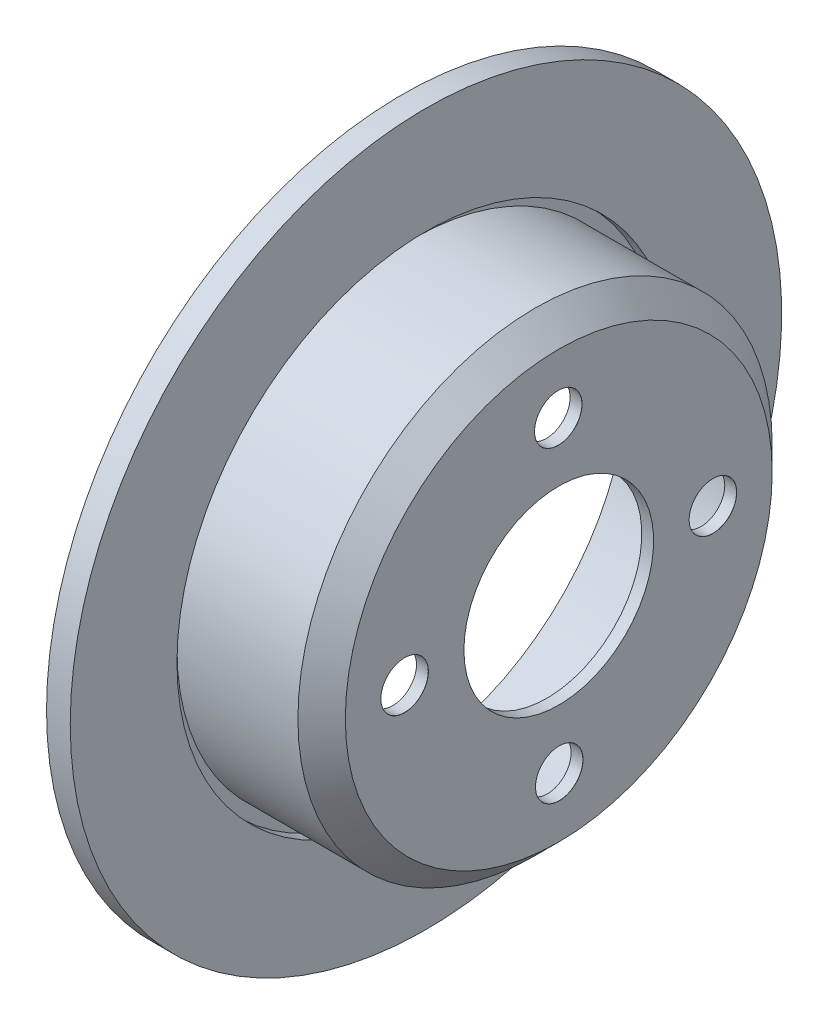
ISO-10303-21;
HEADER;
FILE_DESCRIPTION(('STEP AP214'),'2;1');
FILE_NAME('part.step','',(''),(''),'','','');
FILE_SCHEMA(('AUTOMOTIVE_DESIGN { 1 0 10303 214 1 1 1 1 }'));
ENDSEC;
DATA;
#1=APPLICATION_CONTEXT('core data for automotive mechanical design processes');
#2=APPLICATION_PROTOCOL_DEFINITION('international standard','automotive_design',2000,#1);
#3=PRODUCT_CONTEXT('',#1,'mechanical');
#4=PRODUCT('Part','Part','',(#3));
#5=PRODUCT_RELATED_PRODUCT_CATEGORY('part','',(#4));
#6=PRODUCT_DEFINITION_FORMATION('','',#4);
#7=PRODUCT_DEFINITION_CONTEXT('part definition',#1,'design');
#8=PRODUCT_DEFINITION('design','',#6,#7);
#9=PRODUCT_DEFINITION_SHAPE('','',#8);
#10=(LENGTH_UNIT() NAMED_UNIT(*) SI_UNIT(.MILLI.,.METRE.));
#11=(NAMED_UNIT(*) PLANE_ANGLE_UNIT() SI_UNIT($,.RADIAN.));
#12=(NAMED_UNIT(*) SI_UNIT($,.STERADIAN.) SOLID_ANGLE_UNIT());
#13=UNCERTAINTY_MEASURE_WITH_UNIT(LENGTH_MEASURE(1.E-05),#10,'distance_accuracy_value','');
#14=(GEOMETRIC_REPRESENTATION_CONTEXT(3) GLOBAL_UNCERTAINTY_ASSIGNED_CONTEXT((#13)) GLOBAL_UNIT_ASSIGNED_CONTEXT((#10,
#11,#12)) REPRESENTATION_CONTEXT('',''));
#15=CARTESIAN_POINT('',(0.,0.,0.));
#16=DIRECTION('',(0.,0.,1.));
#17=DIRECTION('',(1.,0.,0.));
#18=AXIS2_PLACEMENT_3D('',#15,#16,#17);
#19=CARTESIAN_POINT('',(0.,0.,0.));
#20=DIRECTION('',(-1.,0.,0.));
#21=DIRECTION('',(0.,0.,1.));
#22=AXIS2_PLACEMENT_3D('',#19,#20,#21);
#23=CYLINDRICAL_SURFACE('',#22,40.);
#24=CARTESIAN_POINT('',(0.,0.,0.));
#25=DIRECTION('',(-1.,0.,0.));
#26=DIRECTION('',(0.,0.,1.));
#27=AXIS2_PLACEMENT_3D('',#24,#25,#26);
#28=CIRCLE('',#27,40.);
#29=CARTESIAN_POINT('',(0.,0.,40.));
#30=VERTEX_POINT('',#29);
#31=EDGE_CURVE('E10',#30,#30,#28,.T.);
#32=ORIENTED_EDGE('',*,*,#31,.F.);
#33=EDGE_LOOP('',(#32));
#34=FACE_BOUND('',#33,.T.);
#35=CARTESIAN_POINT('',(-5.,0.,0.));
#36=DIRECTION('',(-1.,0.,0.));
#37=DIRECTION('',(0.,0.,1.));
#38=AXIS2_PLACEMENT_3D('',#35,#36,#37);
#39=CIRCLE('',#38,40.);
#40=CARTESIAN_POINT('',(-5.,0.,40.));
#41=VERTEX_POINT('',#40);
#42=EDGE_CURVE('E58',#41,#41,#39,.T.);
#43=ORIENTED_EDGE('',*,*,#42,.T.);
#44=EDGE_LOOP('',(#43));
#45=FACE_BOUND('',#44,.T.);
#46=ADVANCED_FACE('F39',(#34,#45),#23,.F.);
#47=CARTESIAN_POINT('',(0.,40.,0.));
#48=DIRECTION('',(-1.,0.,0.));
#49=DIRECTION('',(0.,0.,1.));
#50=AXIS2_PLACEMENT_3D('',#47,#48,#49);
#51=PLANE('',#50);
#52=CARTESIAN_POINT('',(0.,64.9996786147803,0.204401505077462));
#53=DIRECTION('',(1.,0.,0.));
#54=DIRECTION('',(0.,0.,-1.));
#55=AXIS2_PLACEMENT_3D('',#52,#53,#54);
#56=CIRCLE('',#55,10.025);
#57=CARTESIAN_POINT('',(0.,64.9996786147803,-9.82059849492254));
#58=VERTEX_POINT('',#57);
#59=EDGE_CURVE('E205',#58,#58,#56,.T.);
#60=ORIENTED_EDGE('',*,*,#59,.F.);
#61=EDGE_LOOP('',(#60));
#62=FACE_BOUND('',#61,.T.);
#63=CARTESIAN_POINT('',(0.,-0.204401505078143,64.9996786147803));
#64=DIRECTION('',(1.,0.,0.));
#65=DIRECTION('',(0.,0.,-1.));
#66=AXIS2_PLACEMENT_3D('',#63,#64,#65);
#67=CIRCLE('',#66,10.025);
#68=CARTESIAN_POINT('',(0.,-0.204401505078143,54.9746786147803));
#69=VERTEX_POINT('',#68);
#70=EDGE_CURVE('E73',#69,#69,#67,.T.);
#71=ORIENTED_EDGE('',*,*,#70,.F.);
#72=EDGE_LOOP('',(#71));
#73=FACE_BOUND('',#72,.T.);
#74=CARTESIAN_POINT('',(0.,-64.9996786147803,-0.204401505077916));
#75=DIRECTION('',(1.,0.,0.));
#76=DIRECTION('',(0.,0.,-1.));
#77=AXIS2_PLACEMENT_3D('',#74,#75,#76);
#78=CIRCLE('',#77,10.025);
#79=CARTESIAN_POINT('',(0.,-64.9996786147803,-10.2294015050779));
#80=VERTEX_POINT('',#79);
#81=EDGE_CURVE('E66',#80,#80,#78,.T.);
#82=ORIENTED_EDGE('',*,*,#81,.F.);
#83=EDGE_LOOP('',(#82));
#84=FACE_BOUND('',#83,.T.);
#85=CARTESIAN_POINT('',(0.,0.204401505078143,-64.9996786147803));
#86=DIRECTION('',(1.,0.,0.));
#87=DIRECTION('',(0.,0.,-1.));
#88=AXIS2_PLACEMENT_3D('',#85,#86,#87);
#89=CIRCLE('',#88,10.025);
#90=CARTESIAN_POINT('',(0.,0.204401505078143,-75.0246786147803));
#91=VERTEX_POINT('',#90);
#92=EDGE_CURVE('E62',#91,#91,#89,.T.);
#93=ORIENTED_EDGE('',*,*,#92,.F.);
#94=EDGE_LOOP('',(#93));
#95=FACE_BOUND('',#94,.T.);
#96=CARTESIAN_POINT('',(0.,0.,0.));
#97=DIRECTION('',(-1.,0.,0.));
#98=DIRECTION('',(0.,0.,1.));
#99=AXIS2_PLACEMENT_3D('',#96,#97,#98);
#100=CIRCLE('',#99,90.);
#101=CARTESIAN_POINT('',(0.,0.,90.));
#102=VERTEX_POINT('',#101);
#103=EDGE_CURVE('E46',#102,#102,#100,.T.);
#104=ORIENTED_EDGE('',*,*,#103,.F.);
#105=EDGE_LOOP('',(#104));
#106=FACE_BOUND('',#105,.T.);
#107=ORIENTED_EDGE('',*,*,#31,.T.);
#108=EDGE_LOOP('',(#107));
#109=FACE_BOUND('',#108,.T.);
#110=ADVANCED_FACE('F120',(#62,#73,#84,#95,#106,#109),#51,.F.);
#111=CARTESIAN_POINT('',(0.,0.,0.));
#112=DIRECTION('',(-1.,0.,0.));
#113=DIRECTION('',(0.,0.,1.));
#114=AXIS2_PLACEMENT_3D('',#111,#112,#113);
#115=CONICAL_SURFACE('',#114,90.,0.78539816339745);
#116=CARTESIAN_POINT('',(-9.99999999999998,0.,0.));
#117=DIRECTION('',(-1.,0.,0.));
#118=DIRECTION('',(0.,0.,1.));
#119=AXIS2_PLACEMENT_3D('',#116,#117,#118);
#120=CIRCLE('',#119,100.);
#121=CARTESIAN_POINT('',(-9.99999999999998,0.,100.));
#122=VERTEX_POINT('',#121);
#123=EDGE_CURVE('E51',#122,#122,#120,.T.);
#124=ORIENTED_EDGE('',*,*,#123,.F.);
#125=EDGE_LOOP('',(#124));
#126=FACE_BOUND('',#125,.T.);
#127=ORIENTED_EDGE('',*,*,#103,.T.);
#128=EDGE_LOOP('',(#127));
#129=FACE_BOUND('',#128,.T.);
#130=ADVANCED_FACE('F117',(#126,#129),#115,.T.);
#131=CARTESIAN_POINT('',(0.,0.,0.));
#132=DIRECTION('',(-1.,0.,0.));
#133=DIRECTION('',(0.,0.,1.));
#134=AXIS2_PLACEMENT_3D('',#131,#132,#133);
#135=CYLINDRICAL_SURFACE('',#134,100.);
#136=CARTESIAN_POINT('',(-61.,0.,0.));
#137=DIRECTION('',(-1.,0.,0.));
#138=DIRECTION('',(0.,0.,1.));
#139=AXIS2_PLACEMENT_3D('',#136,#137,#138);
#140=CIRCLE('',#139,100.);
#141=CARTESIAN_POINT('',(-61.,0.,100.));
#142=VERTEX_POINT('',#141);
#143=EDGE_CURVE('E110',#142,#142,#140,.T.);
#144=ORIENTED_EDGE('',*,*,#143,.F.);
#145=EDGE_LOOP('',(#144));
#146=FACE_BOUND('',#145,.T.);
#147=ORIENTED_EDGE('',*,*,#123,.T.);
#148=EDGE_LOOP('',(#147));
#149=FACE_BOUND('',#148,.T.);
#150=ADVANCED_FACE('F115',(#146,#149),#135,.T.);
#151=CARTESIAN_POINT('',(-61.,105.,0.));
#152=DIRECTION('',(-1.,0.,0.));
#153=DIRECTION('',(0.,0.,1.));
#154=AXIS2_PLACEMENT_3D('',#151,#152,#153);
#155=PLANE('',#154);
#156=CARTESIAN_POINT('',(-61.,0.,0.));
#157=DIRECTION('',(-1.,0.,0.));
#158=DIRECTION('',(0.,0.,1.));
#159=AXIS2_PLACEMENT_3D('',#156,#157,#158);
#160=CIRCLE('',#159,105.);
#161=CARTESIAN_POINT('',(-61.,0.,105.));
#162=VERTEX_POINT('',#161);
#163=EDGE_CURVE('E107',#162,#162,#160,.T.);
#164=ORIENTED_EDGE('',*,*,#163,.F.);
#165=EDGE_LOOP('',(#164));
#166=FACE_BOUND('',#165,.T.);
#167=ORIENTED_EDGE('',*,*,#143,.T.);
#168=EDGE_LOOP('',(#167));
#169=FACE_BOUND('',#168,.T.);
#170=ADVANCED_FACE('F135',(#166,#169),#155,.F.);
#171=CARTESIAN_POINT('',(0.,0.,0.));
#172=DIRECTION('',(-1.,0.,0.));
#173=DIRECTION('',(0.,0.,1.));
#174=AXIS2_PLACEMENT_3D('',#171,#172,#173);
#175=CYLINDRICAL_SURFACE('',#174,105.);
#176=CARTESIAN_POINT('',(-56.,0.,0.));
#177=DIRECTION('',(-1.,0.,0.));
#178=DIRECTION('',(0.,0.,1.));
#179=AXIS2_PLACEMENT_3D('',#176,#177,#178);
#180=CIRCLE('',#179,105.);
#181=CARTESIAN_POINT('',(-56.,0.,105.));
#182=VERTEX_POINT('',#181);
#183=EDGE_CURVE('E104',#182,#182,#180,.T.);
#184=ORIENTED_EDGE('',*,*,#183,.F.);
#185=EDGE_LOOP('',(#184));
#186=FACE_BOUND('',#185,.T.);
#187=ORIENTED_EDGE('',*,*,#163,.T.);
#188=EDGE_LOOP('',(#187));
#189=FACE_BOUND('',#188,.T.);
#190=ADVANCED_FACE('F139',(#186,#189),#175,.F.);
#191=CARTESIAN_POINT('',(-56.,105.,0.));
#192=DIRECTION('',(-1.,0.,0.));
#193=DIRECTION('',(0.,0.,1.));
#194=AXIS2_PLACEMENT_3D('',#191,#192,#193);
#195=PLANE('',#194);
#196=CARTESIAN_POINT('',(-56.,0.,0.));
#197=DIRECTION('',(-1.,0.,0.));
#198=DIRECTION('',(0.,0.,1.));
#199=AXIS2_PLACEMENT_3D('',#196,#197,#198);
#200=CIRCLE('',#199,150.);
#201=CARTESIAN_POINT('',(-56.,0.,150.));
#202=VERTEX_POINT('',#201);
#203=EDGE_CURVE('E101',#202,#202,#200,.T.);
#204=ORIENTED_EDGE('',*,*,#203,.F.);
#205=EDGE_LOOP('',(#204));
#206=FACE_BOUND('',#205,.T.);
#207=ORIENTED_EDGE('',*,*,#183,.T.);
#208=EDGE_LOOP('',(#207));
#209=FACE_BOUND('',#208,.T.);
#210=ADVANCED_FACE('F143',(#206,#209),#195,.F.);
#211=CARTESIAN_POINT('',(0.,0.,0.));
#212=DIRECTION('',(-1.,0.,0.));
#213=DIRECTION('',(0.,0.,1.));
#214=AXIS2_PLACEMENT_3D('',#211,#212,#213);
#215=CYLINDRICAL_SURFACE('',#214,150.);
#216=CARTESIAN_POINT('',(-66.,0.,0.));
#217=DIRECTION('',(-1.,0.,0.));
#218=DIRECTION('',(0.,0.,1.));
#219=AXIS2_PLACEMENT_3D('',#216,#217,#218);
#220=CIRCLE('',#219,150.);
#221=CARTESIAN_POINT('',(-66.,0.,150.));
#222=VERTEX_POINT('',#221);
#223=EDGE_CURVE('E98',#222,#222,#220,.T.);
#224=ORIENTED_EDGE('',*,*,#223,.F.);
#225=EDGE_LOOP('',(#224));
#226=FACE_BOUND('',#225,.T.);
#227=ORIENTED_EDGE('',*,*,#203,.T.);
#228=EDGE_LOOP('',(#227));
#229=FACE_BOUND('',#228,.T.);
#230=ADVANCED_FACE('F147',(#226,#229),#215,.T.);
#231=CARTESIAN_POINT('',(-66.,150.,0.));
#232=DIRECTION('',(1.,0.,0.));
#233=DIRECTION('',(0.,0.,-1.));
#234=AXIS2_PLACEMENT_3D('',#231,#232,#233);
#235=PLANE('',#234);
#236=CARTESIAN_POINT('',(-66.,0.,0.));
#237=DIRECTION('',(-1.,0.,0.));
#238=DIRECTION('',(0.,0.,1.));
#239=AXIS2_PLACEMENT_3D('',#236,#237,#238);
#240=CIRCLE('',#239,95.);
#241=CARTESIAN_POINT('',(-66.,0.,95.));
#242=VERTEX_POINT('',#241);
#243=EDGE_CURVE('E95',#242,#242,#240,.T.);
#244=ORIENTED_EDGE('',*,*,#243,.F.);
#245=EDGE_LOOP('',(#244));
#246=FACE_BOUND('',#245,.T.);
#247=ORIENTED_EDGE('',*,*,#223,.T.);
#248=EDGE_LOOP('',(#247));
#249=FACE_BOUND('',#248,.T.);
#250=ADVANCED_FACE('F151',(#246,#249),#235,.F.);
#251=CARTESIAN_POINT('',(0.,0.,0.));
#252=DIRECTION('',(-1.,0.,0.));
#253=DIRECTION('',(0.,0.,1.));
#254=AXIS2_PLACEMENT_3D('',#251,#252,#253);
#255=CYLINDRICAL_SURFACE('',#254,95.);
#256=CARTESIAN_POINT('',(-12.0710678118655,0.,0.));
#257=DIRECTION('',(-1.,0.,0.));
#258=DIRECTION('',(0.,0.,1.));
#259=AXIS2_PLACEMENT_3D('',#256,#257,#258);
#260=CIRCLE('',#259,95.);
#261=CARTESIAN_POINT('',(-12.0710678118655,0.,95.));
#262=VERTEX_POINT('',#261);
#263=EDGE_CURVE('E92',#262,#262,#260,.T.);
#264=ORIENTED_EDGE('',*,*,#263,.F.);
#265=EDGE_LOOP('',(#264));
#266=FACE_BOUND('',#265,.T.);
#267=ORIENTED_EDGE('',*,*,#243,.T.);
#268=EDGE_LOOP('',(#267));
#269=FACE_BOUND('',#268,.T.);
#270=ADVANCED_FACE('F155',(#266,#269),#255,.F.);
#271=CARTESIAN_POINT('',(-12.0710678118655,0.,0.));
#272=DIRECTION('',(-1.,0.,0.));
#273=DIRECTION('',(0.,0.,1.));
#274=AXIS2_PLACEMENT_3D('',#271,#272,#273);
#275=CONICAL_SURFACE('',#274,95.,0.78539816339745);
#276=CARTESIAN_POINT('',(-5.,0.,0.));
#277=DIRECTION('',(-1.,0.,0.));
#278=DIRECTION('',(0.,0.,1.));
#279=AXIS2_PLACEMENT_3D('',#276,#277,#278);
#280=CIRCLE('',#279,87.9289321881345);
#281=CARTESIAN_POINT('',(-5.,0.,87.9289321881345));
#282=VERTEX_POINT('',#281);
#283=EDGE_CURVE('E89',#282,#282,#280,.T.);
#284=ORIENTED_EDGE('',*,*,#283,.F.);
#285=EDGE_LOOP('',(#284));
#286=FACE_BOUND('',#285,.T.);
#287=ORIENTED_EDGE('',*,*,#263,.T.);
#288=EDGE_LOOP('',(#287));
#289=FACE_BOUND('',#288,.T.);
#290=ADVANCED_FACE('F159',(#286,#289),#275,.F.);
#291=CARTESIAN_POINT('',(-5.,40.,0.));
#292=DIRECTION('',(1.,0.,0.));
#293=DIRECTION('',(0.,0.,-1.));
#294=AXIS2_PLACEMENT_3D('',#291,#292,#293);
#295=PLANE('',#294);
#296=CARTESIAN_POINT('',(-5.,64.9996786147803,0.204401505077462));
#297=DIRECTION('',(1.,0.,0.));
#298=DIRECTION('',(0.,0.,-1.));
#299=AXIS2_PLACEMENT_3D('',#296,#297,#298);
#300=CIRCLE('',#299,9.99999999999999);
#301=CARTESIAN_POINT('',(-5.,64.9996786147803,-9.79559849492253));
#302=VERTEX_POINT('',#301);
#303=EDGE_CURVE('E42',#302,#302,#300,.T.);
#304=ORIENTED_EDGE('',*,*,#303,.T.);
#305=EDGE_LOOP('',(#304));
#306=FACE_BOUND('',#305,.T.);
#307=CARTESIAN_POINT('',(-5.,-0.204401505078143,64.9996786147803));
#308=DIRECTION('',(1.,0.,0.));
#309=DIRECTION('',(0.,0.,-1.));
#310=AXIS2_PLACEMENT_3D('',#307,#308,#309);
#311=CIRCLE('',#310,9.99999999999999);
#312=CARTESIAN_POINT('',(-5.,-0.204401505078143,54.9996786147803));
#313=VERTEX_POINT('',#312);
#314=EDGE_CURVE('E64',#313,#313,#311,.T.);
#315=ORIENTED_EDGE('',*,*,#314,.T.);
#316=EDGE_LOOP('',(#315));
#317=FACE_BOUND('',#316,.T.);
#318=CARTESIAN_POINT('',(-5.,-64.9996786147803,-0.204401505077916));
#319=DIRECTION('',(1.,0.,0.));
#320=DIRECTION('',(0.,0.,-1.));
#321=AXIS2_PLACEMENT_3D('',#318,#319,#320);
#322=CIRCLE('',#321,10.);
#323=CARTESIAN_POINT('',(-5.,-64.9996786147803,-10.2044015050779));
#324=VERTEX_POINT('',#323);
#325=EDGE_CURVE('E60',#324,#324,#322,.T.);
#326=ORIENTED_EDGE('',*,*,#325,.T.);
#327=EDGE_LOOP('',(#326));
#328=FACE_BOUND('',#327,.T.);
#329=CARTESIAN_POINT('',(-5.,0.204401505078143,-64.9996786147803));
#330=DIRECTION('',(1.,0.,0.));
#331=DIRECTION('',(0.,0.,-1.));
#332=AXIS2_PLACEMENT_3D('',#329,#330,#331);
#333=CIRCLE('',#332,9.99999999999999);
#334=CARTESIAN_POINT('',(-5.,0.204401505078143,-74.9996786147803));
#335=VERTEX_POINT('',#334);
#336=EDGE_CURVE('E55',#335,#335,#333,.T.);
#337=ORIENTED_EDGE('',*,*,#336,.T.);
#338=EDGE_LOOP('',(#337));
#339=FACE_BOUND('',#338,.T.);
#340=ORIENTED_EDGE('',*,*,#42,.F.);
#341=EDGE_LOOP('',(#340));
#342=FACE_BOUND('',#341,.T.);
#343=ORIENTED_EDGE('',*,*,#283,.T.);
#344=EDGE_LOOP('',(#343));
#345=FACE_BOUND('',#344,.T.);
#346=ADVANCED_FACE('F163',(#306,#317,#328,#339,#342,#345),#295,.F.);
#347=CARTESIAN_POINT('',(0.,0.204401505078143,-64.9996786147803));
#348=DIRECTION('',(1.,0.,0.));
#349=DIRECTION('',(0.,0.,-1.));
#350=AXIS2_PLACEMENT_3D('',#347,#348,#349);
#351=CYLINDRICAL_SURFACE('',#350,9.99999999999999);
#352=CARTESIAN_POINT('',(-0.0249999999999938,0.204401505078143,-64.9996786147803));
#353=DIRECTION('',(1.,0.,0.));
#354=DIRECTION('',(0.,0.,-1.));
#355=AXIS2_PLACEMENT_3D('',#352,#353,#354);
#356=CIRCLE('',#355,10.);
#357=CARTESIAN_POINT('',(-0.0249999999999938,0.204401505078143,-74.9996786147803));
#358=VERTEX_POINT('',#357);
#359=EDGE_CURVE('E59',#358,#358,#356,.T.);
#360=ORIENTED_EDGE('',*,*,#359,.T.);
#361=EDGE_LOOP('',(#360));
#362=FACE_BOUND('',#361,.T.);
#363=ORIENTED_EDGE('',*,*,#336,.F.);
#364=EDGE_LOOP('',(#363));
#365=FACE_BOUND('',#364,.T.);
#366=ADVANCED_FACE('F167',(#362,#365),#351,.F.);
#367=CARTESIAN_POINT('',(0.,0.204401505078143,-64.9996786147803));
#368=DIRECTION('',(1.,0.,0.));
#369=DIRECTION('',(0.,0.,-1.));
#370=AXIS2_PLACEMENT_3D('',#367,#368,#369);
#371=CONICAL_SURFACE('',#370,10.025,0.785398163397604);
#372=ORIENTED_EDGE('',*,*,#359,.F.);
#373=EDGE_LOOP('',(#372));
#374=FACE_BOUND('',#373,.T.);
#375=ORIENTED_EDGE('',*,*,#92,.T.);
#376=EDGE_LOOP('',(#375));
#377=FACE_BOUND('',#376,.T.);
#378=ADVANCED_FACE('F171',(#374,#377),#371,.F.);
#379=CARTESIAN_POINT('',(0.,-64.9996786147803,-0.204401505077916));
#380=DIRECTION('',(1.,0.,0.));
#381=DIRECTION('',(0.,0.,-1.));
#382=AXIS2_PLACEMENT_3D('',#379,#380,#381);
#383=CYLINDRICAL_SURFACE('',#382,10.);
#384=CARTESIAN_POINT('',(-0.0249999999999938,-64.9996786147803,-0.204401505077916));
#385=DIRECTION('',(1.,0.,0.));
#386=DIRECTION('',(0.,0.,-1.));
#387=AXIS2_PLACEMENT_3D('',#384,#385,#386);
#388=CIRCLE('',#387,10.);
#389=CARTESIAN_POINT('',(-0.0249999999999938,-64.9996786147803,-10.2044015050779));
#390=VERTEX_POINT('',#389);
#391=EDGE_CURVE('E63',#390,#390,#388,.T.);
#392=ORIENTED_EDGE('',*,*,#391,.T.);
#393=EDGE_LOOP('',(#392));
#394=FACE_BOUND('',#393,.T.);
#395=ORIENTED_EDGE('',*,*,#325,.F.);
#396=EDGE_LOOP('',(#395));
#397=FACE_BOUND('',#396,.T.);
#398=ADVANCED_FACE('F175',(#394,#397),#383,.F.);
#399=CARTESIAN_POINT('',(0.,-64.9996786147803,-0.204401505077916));
#400=DIRECTION('',(1.,0.,0.));
#401=DIRECTION('',(0.,0.,-1.));
#402=AXIS2_PLACEMENT_3D('',#399,#400,#401);
#403=CONICAL_SURFACE('',#402,10.025,0.785398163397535);
#404=ORIENTED_EDGE('',*,*,#391,.F.);
#405=EDGE_LOOP('',(#404));
#406=FACE_BOUND('',#405,.T.);
#407=ORIENTED_EDGE('',*,*,#81,.T.);
#408=EDGE_LOOP('',(#407));
#409=FACE_BOUND('',#408,.T.);
#410=ADVANCED_FACE('F179',(#406,#409),#403,.F.);
#411=CARTESIAN_POINT('',(0.,-0.204401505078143,64.9996786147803));
#412=DIRECTION('',(1.,0.,0.));
#413=DIRECTION('',(0.,0.,-1.));
#414=AXIS2_PLACEMENT_3D('',#411,#412,#413);
#415=CYLINDRICAL_SURFACE('',#414,9.99999999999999);
#416=CARTESIAN_POINT('',(-0.0249999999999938,-0.204401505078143,64.9996786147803));
#417=DIRECTION('',(1.,0.,0.));
#418=DIRECTION('',(0.,0.,-1.));
#419=AXIS2_PLACEMENT_3D('',#416,#417,#418);
#420=CIRCLE('',#419,10.);
#421=CARTESIAN_POINT('',(-0.0249999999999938,-0.204401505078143,54.9996786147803));
#422=VERTEX_POINT('',#421);
#423=EDGE_CURVE('E67',#422,#422,#420,.T.);
#424=ORIENTED_EDGE('',*,*,#423,.T.);
#425=EDGE_LOOP('',(#424));
#426=FACE_BOUND('',#425,.T.);
#427=ORIENTED_EDGE('',*,*,#314,.F.);
#428=EDGE_LOOP('',(#427));
#429=FACE_BOUND('',#428,.T.);
#430=ADVANCED_FACE('F183',(#426,#429),#415,.F.);
#431=CARTESIAN_POINT('',(0.,-0.204401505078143,64.9996786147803));
#432=DIRECTION('',(1.,0.,0.));
#433=DIRECTION('',(0.,0.,-1.));
#434=AXIS2_PLACEMENT_3D('',#431,#432,#433);
#435=CONICAL_SURFACE('',#434,10.025,0.785398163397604);
#436=ORIENTED_EDGE('',*,*,#423,.F.);
#437=EDGE_LOOP('',(#436));
#438=FACE_BOUND('',#437,.T.);
#439=ORIENTED_EDGE('',*,*,#70,.T.);
#440=EDGE_LOOP('',(#439));
#441=FACE_BOUND('',#440,.T.);
#442=ADVANCED_FACE('F187',(#438,#441),#435,.F.);
#443=CARTESIAN_POINT('',(0.,64.9996786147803,0.204401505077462));
#444=DIRECTION('',(1.,0.,0.));
#445=DIRECTION('',(0.,0.,-1.));
#446=AXIS2_PLACEMENT_3D('',#443,#444,#445);
#447=CYLINDRICAL_SURFACE('',#446,9.99999999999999);
#448=CARTESIAN_POINT('',(-0.0249999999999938,64.9996786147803,0.204401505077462));
#449=DIRECTION('',(1.,0.,0.));
#450=DIRECTION('',(0.,0.,-1.));
#451=AXIS2_PLACEMENT_3D('',#448,#449,#450);
#452=CIRCLE('',#451,9.99999999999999);
#453=CARTESIAN_POINT('',(-0.0249999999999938,64.9996786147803,-9.79559849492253));
#454=VERTEX_POINT('',#453);
#455=EDGE_CURVE('E203',#454,#454,#452,.T.);
#456=ORIENTED_EDGE('',*,*,#455,.T.);
#457=EDGE_LOOP('',(#456));
#458=FACE_BOUND('',#457,.T.);
#459=ORIENTED_EDGE('',*,*,#303,.F.);
#460=EDGE_LOOP('',(#459));
#461=FACE_BOUND('',#460,.T.);
#462=ADVANCED_FACE('F190',(#458,#461),#447,.F.);
#463=CARTESIAN_POINT('',(0.,64.9996786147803,0.204401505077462));
#464=DIRECTION('',(1.,0.,0.));
#465=DIRECTION('',(0.,0.,-1.));
#466=AXIS2_PLACEMENT_3D('',#463,#464,#465);
#467=CONICAL_SURFACE('',#466,10.025,0.785398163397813);
#468=ORIENTED_EDGE('',*,*,#455,.F.);
#469=EDGE_LOOP('',(#468));
#470=FACE_BOUND('',#469,.T.);
#471=ORIENTED_EDGE('',*,*,#59,.T.);
#472=EDGE_LOOP('',(#471));
#473=FACE_BOUND('',#472,.T.);
#474=ADVANCED_FACE('F194',(#470,#473),#467,.F.);
#475=CLOSED_SHELL('',(#46,#110,#130,#150,#170,#190,#210,#230,#250,#270,#290,#346,#366,#378,#398,
#410,#430,#442,#462,#474));
#476=MANIFOLD_SOLID_BREP('B2',#475);
#477=ADVANCED_BREP_SHAPE_REPRESENTATION('',(#18,#476),#14);
#478=SHAPE_DEFINITION_REPRESENTATION(#9,#477);
ENDSEC;
END-ISO-10303-21;
